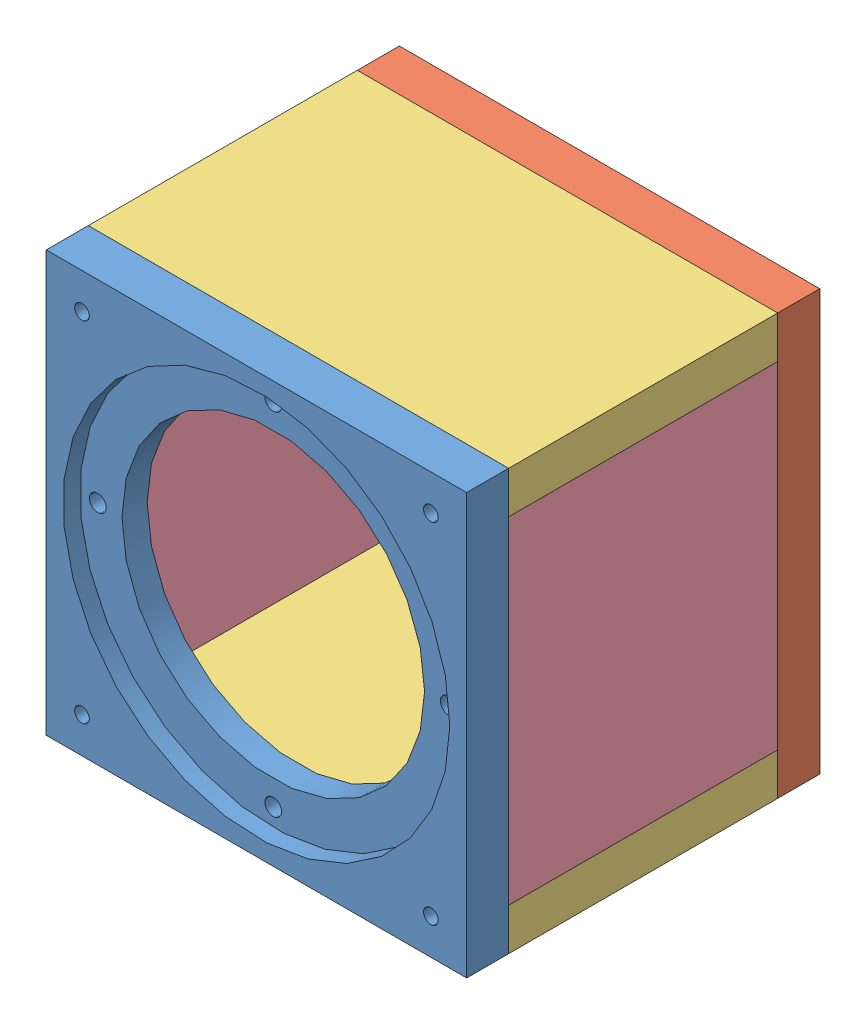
SolidWorks assembly Сборка1.SLDASM, configuration По умолчанию (file format 5000). Lengths in mm.
Overall size (100 100 84).
6 component instances, 4 part files, 14 mates.
Components (placement in the parent):
- morda-1: morda.SLDPRT [По умолчанию] at (-89.6253 -63.4839 48.107) size (100 100 10)
- back-1: back.SLDPRT [По умолчанию] at (-89.6253 -63.4839 -25.893) size (100 100 10)
- verh_niz-1: verh_niz.SLDPRT [По умолчанию] at (-89.6253 26.5161 48.107) size (100 10 64)
- verh_niz-2: verh_niz.SLDPRT [По умолчанию] at (-89.6253 -63.4839 48.107) size (100 10 64)
- levo_pravo-1: levo_pravo.SLDPRT [По умолчанию] at (-89.6253 -53.4839 48.107) size (10 80 64)
- levo_pravo-2: levo_pravo.SLDPRT [По умолчанию] at (0.3747 -53.4839 48.107) size (10 80 64)
Mates (geometry in assembly coordinates):
- Совпадение1: coincident anti-aligned: plane of back-1 through (-80.3064 -2.9871 -15.893) normal (0 0 1); plane of verh_niz-1 through (-80.3064 97.0129 -15.893) normal (0 0 -1)
- Совпадение2: coincident aligned: line of back-1 through (19.6936 97.0129 -15.893) axis (-1 0 0); line of verh_niz-1 through (19.6936 97.0129 -15.893) axis (-1 0 0)
- Совпадение3: coincident: point of back-1; point of verh_niz-1
- Совпадение4: coincident anti-aligned: plane of back-1 through (-80.3064 -2.9871 -15.893) normal (0 0 1); plane of verh_niz-2 through (-80.3064 7.0129 -15.893) normal (0 0 -1)
- Совпадение5: coincident anti-aligned: line of back-1 through (-80.3064 -2.9871 -15.893) axis (1 0 0); line of verh_niz-2 through (19.6936 -2.9871 -15.893) axis (-1 0 0)
- Совпадение6: coincident: point of back-1; point of verh_niz-2
- Совпадение7: coincident anti-aligned: plane of back-1 through (-80.3064 -2.9871 -15.893) normal (0 0 1); plane of levo_pravo-1 through (-70.3064 7.0129 -15.893) normal (0 0 -1)
- Совпадение8: coincident anti-aligned: line of back-1 through (-80.3064 97.0129 -15.893) axis (0 -1 0); line of levo_pravo-1 through (-80.3064 7.0129 -15.893) axis (0 1 0)
- Совпадение9: coincident: point of verh_niz-1; point of levo_pravo-1
- Совпадение10: coincident anti-aligned: plane of back-1 through (-89.6253 -63.4839 -15.893) normal (0 0 1); plane of levo_pravo-2 through (10.3747 -53.4839 -15.893) normal (0 0 -1)
- Совпадение11: coincident aligned: line of back-1 through (10.3747 -63.4839 -15.893) axis (0 1 0); line of levo_pravo-2 through (10.3747 -53.4839 -15.893) axis (0 1 0)
- Совпадение12: coincident: point of verh_niz-1; point of levo_pravo-2
- Совпадение13: coincident anti-aligned: plane of morda-1 through (-89.6253 -63.4839 48.107) normal (0 0 -1); plane of levo_pravo-2 through (10.3747 -53.4839 48.107) normal (0 0 1)
- Совпадение14: coincident: point of morda-1; point of verh_niz-1
